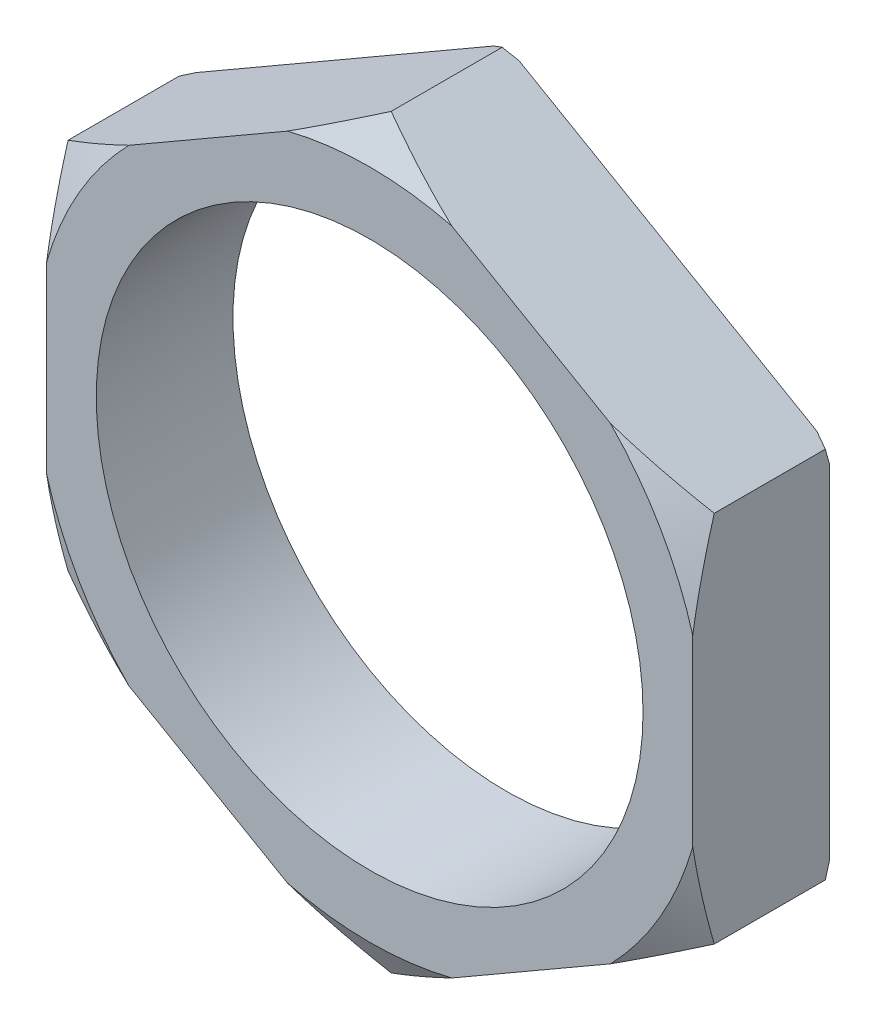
ISO-10303-21;
HEADER;
FILE_DESCRIPTION(('STEP AP214'),'2;1');
FILE_NAME('part.step','',(''),(''),'','','');
FILE_SCHEMA(('AUTOMOTIVE_DESIGN { 1 0 10303 214 1 1 1 1 }'));
ENDSEC;
DATA;
#1=APPLICATION_CONTEXT('core data for automotive mechanical design processes');
#2=APPLICATION_PROTOCOL_DEFINITION('international standard','automotive_design',2000,#1);
#3=PRODUCT_CONTEXT('',#1,'mechanical');
#4=PRODUCT('Part','Part','',(#3));
#5=PRODUCT_RELATED_PRODUCT_CATEGORY('part','',(#4));
#6=PRODUCT_DEFINITION_FORMATION('','',#4);
#7=PRODUCT_DEFINITION_CONTEXT('part definition',#1,'design');
#8=PRODUCT_DEFINITION('design','',#6,#7);
#9=PRODUCT_DEFINITION_SHAPE('','',#8);
#10=(LENGTH_UNIT() NAMED_UNIT(*) SI_UNIT(.MILLI.,.METRE.));
#11=(NAMED_UNIT(*) PLANE_ANGLE_UNIT() SI_UNIT($,.RADIAN.));
#12=(NAMED_UNIT(*) SI_UNIT($,.STERADIAN.) SOLID_ANGLE_UNIT());
#13=UNCERTAINTY_MEASURE_WITH_UNIT(LENGTH_MEASURE(1.E-05),#10,'distance_accuracy_value','');
#14=(GEOMETRIC_REPRESENTATION_CONTEXT(3) GLOBAL_UNCERTAINTY_ASSIGNED_CONTEXT((#13)) GLOBAL_UNIT_ASSIGNED_CONTEXT((#10,
#11,#12)) REPRESENTATION_CONTEXT('',''));
#15=CARTESIAN_POINT('',(0.,0.,0.));
#16=DIRECTION('',(0.,0.,1.));
#17=DIRECTION('',(1.,0.,0.));
#18=AXIS2_PLACEMENT_3D('',#15,#16,#17);
#19=CARTESIAN_POINT('',(0.,0.,4.62902937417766));
#20=DIRECTION('',(0.,0.,-1.));
#21=DIRECTION('',(-1.,0.,0.));
#22=AXIS2_PLACEMENT_3D('',#19,#20,#21);
#23=CONICAL_SURFACE('',#22,15.0201044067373,1.0471975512);
#24=CARTESIAN_POINT('',(12.9999999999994,7.50555349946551,4.63422402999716));
#25=CARTESIAN_POINT('',(12.7279391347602,7.66262791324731,4.72490285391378));
#26=CARTESIAN_POINT('',(12.4548725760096,7.82028296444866,4.81166288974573));
#27=CARTESIAN_POINT('',(11.9070071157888,8.13659323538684,4.97620481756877));
#28=CARTESIAN_POINT('',(11.6322101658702,8.29524732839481,5.053995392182));
#29=CARTESIAN_POINT('',(11.0805896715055,8.61372556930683,5.19965011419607));
#30=CARTESIAN_POINT('',(10.8037658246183,8.77354989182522,5.26751274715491));
#31=CARTESIAN_POINT('',(10.2479963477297,9.09442354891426,5.39227833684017));
#32=CARTESIAN_POINT('',(9.96904890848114,9.25547392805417,5.44917051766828));
#33=CARTESIAN_POINT('',(9.68924211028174,9.41702045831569,5.49999999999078));
#34=B_SPLINE_CURVE_WITH_KNOTS('',3,(#24,#25,#26,#27,#28,#29,#30,#31,#32,#33),.UNSPECIFIED.,.F.,
.F.,(4,2,2,2,4),(0.,0.980939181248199,1.96092067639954,2.94105150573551,3.92214023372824),.UNSPECIFIED.);
#35=CARTESIAN_POINT('',(12.9999999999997,7.50555349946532,4.63422402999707));
#36=VERTEX_POINT('',#35);
#37=CARTESIAN_POINT('',(9.68924211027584,9.41702045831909,5.49999999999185));
#38=VERTEX_POINT('',#37);
#39=EDGE_CURVE('E168',#36,#38,#34,.T.);
#40=ORIENTED_EDGE('',*,*,#39,.T.);
#41=CARTESIAN_POINT('',(0.,0.,5.49999999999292));
#42=DIRECTION('',(0.,0.,-1.));
#43=DIRECTION('',(-1.,0.,0.));
#44=AXIS2_PLACEMENT_3D('',#41,#42,#43);
#45=CIRCLE('',#44,13.5115390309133);
#46=CARTESIAN_POINT('',(13.,3.68261958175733,5.49999999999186));
#47=VERTEX_POINT('',#46);
#48=EDGE_CURVE('E366',#47,#38,#45,.F.);
#49=ORIENTED_EDGE('',*,*,#48,.F.);
#50=CARTESIAN_POINT('',(13.,3.68261958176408,5.4999999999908));
#51=CARTESIAN_POINT('',(13.,4.00571264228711,5.44917051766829));
#52=CARTESIAN_POINT('',(13.,4.32781340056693,5.39227833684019));
#53=CARTESIAN_POINT('',(13.,4.96956071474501,5.26751274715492));
#54=CARTESIAN_POINT('',(13.,5.28920935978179,5.19965011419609));
#55=CARTESIAN_POINT('',(13.,5.92616584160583,5.05399539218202));
#56=CARTESIAN_POINT('',(13.,6.24347402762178,4.97620481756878));
#57=CARTESIAN_POINT('',(13.,6.87609456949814,4.81166288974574));
#58=CARTESIAN_POINT('',(13.,7.19140467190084,4.72490285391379));
#59=CARTESIAN_POINT('',(13.,7.50555349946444,4.63422402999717));
#60=B_SPLINE_CURVE_WITH_KNOTS('',3,(#50,#51,#52,#53,#54,#55,#56,#57,#58,#59),.UNSPECIFIED.,.F.,
.F.,(4,2,2,2,4),(0.,0.981088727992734,1.9612195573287,2.94120105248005,3.92214023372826),.UNSPECIFIED.);
#61=EDGE_CURVE('E459',#47,#36,#60,.T.);
#62=ORIENTED_EDGE('',*,*,#61,.T.);
#63=EDGE_LOOP('',(#40,#49,#62));
#64=FACE_BOUND('',#63,.T.);
#65=ADVANCED_FACE('F14',(#64),#23,.T.);
#66=CARTESIAN_POINT('',(0.,0.,4.62902937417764));
#67=DIRECTION('',(0.,0.,-1.));
#68=DIRECTION('',(0.,1.,0.));
#69=AXIS2_PLACEMENT_3D('',#66,#67,#68);
#70=CONICAL_SURFACE('',#69,15.0201044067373,1.0471975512);
#71=CARTESIAN_POINT('',(0.,0.,5.49999999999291));
#72=DIRECTION('',(0.,0.,-1.));
#73=DIRECTION('',(0.,1.,0.));
#74=AXIS2_PLACEMENT_3D('',#71,#72,#73);
#75=CIRCLE('',#74,13.5115390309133);
#76=CARTESIAN_POINT('',(3.31075788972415,13.0996400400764,5.49999999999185));
#77=VERTEX_POINT('',#76);
#78=CARTESIAN_POINT('',(-3.31075788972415,13.0996400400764,5.49999999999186));
#79=VERTEX_POINT('',#78);
#80=EDGE_CURVE('E166',#77,#79,#75,.F.);
#81=ORIENTED_EDGE('',*,*,#80,.F.);
#82=CARTESIAN_POINT('',(3.31075788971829,13.0996400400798,5.49999999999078));
#83=CARTESIAN_POINT('',(3.03095109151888,13.2611865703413,5.44917051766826));
#84=CARTESIAN_POINT('',(2.75200365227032,13.4222369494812,5.39227833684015));
#85=CARTESIAN_POINT('',(2.19623417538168,13.7431106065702,5.26751274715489));
#86=CARTESIAN_POINT('',(1.91941032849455,13.9029349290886,5.19965011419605));
#87=CARTESIAN_POINT('',(1.36778983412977,14.2214131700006,5.05399539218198));
#88=CARTESIAN_POINT('',(1.09299288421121,14.3800672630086,4.97620481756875));
#89=CARTESIAN_POINT('',(0.545127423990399,14.6963775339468,4.81166288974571));
#90=CARTESIAN_POINT('',(0.272060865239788,14.8540325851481,4.72490285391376));
#91=CARTESIAN_POINT('',(6.18709074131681E-13,15.01110699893,4.63422402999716));
#92=B_SPLINE_CURVE_WITH_KNOTS('',3,(#82,#83,#84,#85,#86,#87,#88,#89,#90,#91),.UNSPECIFIED.,.F.,
.F.,(4,2,2,2,4),(0.,0.981088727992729,1.96121955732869,2.94120105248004,3.92214023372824),.UNSPECIFIED.);
#93=CARTESIAN_POINT('',(-2.96555850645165E-13,15.0111069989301,4.63422402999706));
#94=VERTEX_POINT('',#93);
#95=EDGE_CURVE('E157',#77,#94,#92,.T.);
#96=ORIENTED_EDGE('',*,*,#95,.T.);
#97=CARTESIAN_POINT('',(-5.93037075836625E-13,15.0111069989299,4.63422402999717));
#98=CARTESIAN_POINT('',(-0.272060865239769,14.8540325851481,4.72490285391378));
#99=CARTESIAN_POINT('',(-0.545127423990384,14.6963775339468,4.81166288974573));
#100=CARTESIAN_POINT('',(-1.0929928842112,14.3800672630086,4.97620481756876));
#101=CARTESIAN_POINT('',(-1.36778983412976,14.2214131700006,5.053995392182));
#102=CARTESIAN_POINT('',(-1.91941032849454,13.9029349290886,5.19965011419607));
#103=CARTESIAN_POINT('',(-2.19623417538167,13.7431106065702,5.26751274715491));
#104=CARTESIAN_POINT('',(-2.75200365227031,13.4222369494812,5.39227833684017));
#105=CARTESIAN_POINT('',(-3.03095109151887,13.2611865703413,5.44917051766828));
#106=CARTESIAN_POINT('',(-3.31075788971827,13.0996400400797,5.4999999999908));
#107=B_SPLINE_CURVE_WITH_KNOTS('',3,(#97,#98,#99,#100,#101,#102,#103,#104,#105,#106),
.UNSPECIFIED.,.F.,.F.,(4,2,2,2,4),(0.,0.9809391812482,1.96092067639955,2.94105150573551,
3.92214023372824),.UNSPECIFIED.);
#108=EDGE_CURVE('E18',#94,#79,#107,.T.);
#109=ORIENTED_EDGE('',*,*,#108,.T.);
#110=EDGE_LOOP('',(#81,#96,#109));
#111=FACE_BOUND('',#110,.T.);
#112=ADVANCED_FACE('F164',(#111),#70,.T.);
#113=CARTESIAN_POINT('',(0.,0.,4.62902937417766));
#114=DIRECTION('',(0.,0.,-1.));
#115=DIRECTION('',(-1.,0.,0.));
#116=AXIS2_PLACEMENT_3D('',#113,#114,#115);
#117=CONICAL_SURFACE('',#116,15.0201044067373,1.0471975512);
#118=CARTESIAN_POINT('',(-13.,7.50555349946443,4.63422402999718));
#119=CARTESIAN_POINT('',(-13.,7.19140467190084,4.72490285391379));
#120=CARTESIAN_POINT('',(-13.,6.87609456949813,4.81166288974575));
#121=CARTESIAN_POINT('',(-13.,6.24347402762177,4.97620481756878));
#122=CARTESIAN_POINT('',(-13.,5.92616584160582,5.05399539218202));
#123=CARTESIAN_POINT('',(-13.,5.28920935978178,5.19965011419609));
#124=CARTESIAN_POINT('',(-13.,4.969560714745,5.26751274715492));
#125=CARTESIAN_POINT('',(-13.,4.32781340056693,5.39227833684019));
#126=CARTESIAN_POINT('',(-13.,4.00571264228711,5.44917051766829));
#127=CARTESIAN_POINT('',(-13.,3.68261958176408,5.4999999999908));
#128=B_SPLINE_CURVE_WITH_KNOTS('',3,(#118,#119,#120,#121,#122,#123,#124,#125,#126,#127),
.UNSPECIFIED.,.F.,.F.,(4,2,2,2,4),(0.,0.980939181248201,1.96092067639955,2.94105150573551,
3.92214023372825),.UNSPECIFIED.);
#129=CARTESIAN_POINT('',(-12.9999999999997,7.50555349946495,4.63422402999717));
#130=VERTEX_POINT('',#129);
#131=CARTESIAN_POINT('',(-13.,3.68261958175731,5.49999999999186));
#132=VERTEX_POINT('',#131);
#133=EDGE_CURVE('E209',#130,#132,#128,.T.);
#134=ORIENTED_EDGE('',*,*,#133,.T.);
#135=CARTESIAN_POINT('',(0.,0.,5.49999999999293));
#136=DIRECTION('',(0.,0.,-1.));
#137=DIRECTION('',(-1.,0.,0.));
#138=AXIS2_PLACEMENT_3D('',#135,#136,#137);
#139=CIRCLE('',#138,13.5115390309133);
#140=CARTESIAN_POINT('',(-9.68924211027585,9.41702045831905,5.49999999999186));
#141=VERTEX_POINT('',#140);
#142=EDGE_CURVE('E362',#141,#132,#139,.F.);
#143=ORIENTED_EDGE('',*,*,#142,.F.);
#144=CARTESIAN_POINT('',(-9.68924211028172,9.41702045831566,5.4999999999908));
#145=CARTESIAN_POINT('',(-9.96904890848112,9.25547392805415,5.4491705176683));
#146=CARTESIAN_POINT('',(-10.2479963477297,9.09442354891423,5.39227833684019));
#147=CARTESIAN_POINT('',(-10.8037658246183,8.77354989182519,5.26751274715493));
#148=CARTESIAN_POINT('',(-11.0805896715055,8.6137255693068,5.19965011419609));
#149=CARTESIAN_POINT('',(-11.6322101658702,8.29524732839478,5.05399539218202));
#150=CARTESIAN_POINT('',(-11.9070071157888,8.13659323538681,4.97620481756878));
#151=CARTESIAN_POINT('',(-12.4548725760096,7.82028296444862,4.81166288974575));
#152=CARTESIAN_POINT('',(-12.7279391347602,7.66262791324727,4.72490285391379));
#153=CARTESIAN_POINT('',(-12.9999999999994,7.50555349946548,4.63422402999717));
#154=B_SPLINE_CURVE_WITH_KNOTS('',3,(#144,#145,#146,#147,#148,#149,#150,#151,#152,#153),
.UNSPECIFIED.,.F.,.F.,(4,2,2,2,4),(0.,0.981088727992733,1.96121955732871,2.94120105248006,
3.92214023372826),.UNSPECIFIED.);
#155=EDGE_CURVE('E152',#141,#130,#154,.T.);
#156=ORIENTED_EDGE('',*,*,#155,.T.);
#157=EDGE_LOOP('',(#134,#143,#156));
#158=FACE_BOUND('',#157,.T.);
#159=ADVANCED_FACE('F198',(#158),#117,.T.);
#160=CARTESIAN_POINT('',(0.,0.,4.62902937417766));
#161=DIRECTION('',(0.,0.,-1.));
#162=DIRECTION('',(-1.,0.,0.));
#163=AXIS2_PLACEMENT_3D('',#160,#161,#162);
#164=CONICAL_SURFACE('',#163,15.0201044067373,1.0471975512);
#165=CARTESIAN_POINT('',(-12.9999999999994,-7.50555349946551,4.63422402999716));
#166=CARTESIAN_POINT('',(-12.7279391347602,-7.66262791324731,4.72490285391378));
#167=CARTESIAN_POINT('',(-12.4548725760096,-7.82028296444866,4.81166288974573));
#168=CARTESIAN_POINT('',(-11.9070071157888,-8.13659323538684,4.97620481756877));
#169=CARTESIAN_POINT('',(-11.6322101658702,-8.29524732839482,5.053995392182));
#170=CARTESIAN_POINT('',(-11.0805896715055,-8.61372556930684,5.19965011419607));
#171=CARTESIAN_POINT('',(-10.8037658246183,-8.77354989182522,5.26751274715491));
#172=CARTESIAN_POINT('',(-10.2479963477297,-9.09442354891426,5.39227833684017));
#173=CARTESIAN_POINT('',(-9.96904890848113,-9.25547392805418,5.44917051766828));
#174=CARTESIAN_POINT('',(-9.68924211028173,-9.41702045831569,5.49999999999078));
#175=B_SPLINE_CURVE_WITH_KNOTS('',3,(#165,#166,#167,#168,#169,#170,#171,#172,#173,#174),
.UNSPECIFIED.,.F.,.F.,(4,2,2,2,4),(0.,0.980939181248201,1.96092067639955,2.94105150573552,
3.92214023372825),.UNSPECIFIED.);
#176=CARTESIAN_POINT('',(-12.9999999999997,-7.50555349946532,4.63422402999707));
#177=VERTEX_POINT('',#176);
#178=CARTESIAN_POINT('',(-9.68924211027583,-9.41702045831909,5.49999999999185));
#179=VERTEX_POINT('',#178);
#180=EDGE_CURVE('E245',#177,#179,#175,.T.);
#181=ORIENTED_EDGE('',*,*,#180,.T.);
#182=CARTESIAN_POINT('',(0.,0.,5.49999999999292));
#183=DIRECTION('',(0.,0.,-1.));
#184=DIRECTION('',(-1.,0.,0.));
#185=AXIS2_PLACEMENT_3D('',#182,#183,#184);
#186=CIRCLE('',#185,13.5115390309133);
#187=CARTESIAN_POINT('',(-13.,-3.68261958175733,5.49999999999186));
#188=VERTEX_POINT('',#187);
#189=EDGE_CURVE('E343',#188,#179,#186,.F.);
#190=ORIENTED_EDGE('',*,*,#189,.F.);
#191=CARTESIAN_POINT('',(-13.,-3.68261958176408,5.4999999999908));
#192=CARTESIAN_POINT('',(-13.,-4.00571264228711,5.44917051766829));
#193=CARTESIAN_POINT('',(-13.,-4.32781340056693,5.39227833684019));
#194=CARTESIAN_POINT('',(-13.,-4.96956071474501,5.26751274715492));
#195=CARTESIAN_POINT('',(-13.,-5.28920935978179,5.19965011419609));
#196=CARTESIAN_POINT('',(-13.,-5.92616584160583,5.05399539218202));
#197=CARTESIAN_POINT('',(-13.,-6.24347402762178,4.97620481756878));
#198=CARTESIAN_POINT('',(-13.,-6.87609456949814,4.81166288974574));
#199=CARTESIAN_POINT('',(-13.,-7.19140467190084,4.72490285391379));
#200=CARTESIAN_POINT('',(-13.,-7.50555349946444,4.63422402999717));
#201=B_SPLINE_CURVE_WITH_KNOTS('',3,(#191,#192,#193,#194,#195,#196,#197,#198,#199,#200),
.UNSPECIFIED.,.F.,.F.,(4,2,2,2,4),(0.,0.981088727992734,1.9612195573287,2.94120105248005,
3.92214023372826),.UNSPECIFIED.);
#202=EDGE_CURVE('E344',#188,#177,#201,.T.);
#203=ORIENTED_EDGE('',*,*,#202,.T.);
#204=EDGE_LOOP('',(#181,#190,#203));
#205=FACE_BOUND('',#204,.T.);
#206=ADVANCED_FACE('F203',(#205),#164,.T.);
#207=CARTESIAN_POINT('',(0.,0.,4.62902937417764));
#208=DIRECTION('',(0.,0.,-1.));
#209=DIRECTION('',(0.,1.,0.));
#210=AXIS2_PLACEMENT_3D('',#207,#208,#209);
#211=CONICAL_SURFACE('',#210,15.0201044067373,1.0471975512);
#212=CARTESIAN_POINT('',(5.90305715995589E-13,-15.0111069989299,4.63422402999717));
#213=CARTESIAN_POINT('',(0.272060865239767,-14.8540325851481,4.72490285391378));
#214=CARTESIAN_POINT('',(0.545127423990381,-14.6963775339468,4.81166288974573));
#215=CARTESIAN_POINT('',(1.09299288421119,-14.3800672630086,4.97620481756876));
#216=CARTESIAN_POINT('',(1.36778983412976,-14.2214131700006,5.053995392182));
#217=CARTESIAN_POINT('',(1.91941032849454,-13.9029349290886,5.19965011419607));
#218=CARTESIAN_POINT('',(2.19623417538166,-13.7431106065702,5.2675127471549));
#219=CARTESIAN_POINT('',(2.75200365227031,-13.4222369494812,5.39227833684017));
#220=CARTESIAN_POINT('',(3.03095109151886,-13.2611865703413,5.44917051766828));
#221=CARTESIAN_POINT('',(3.31075788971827,-13.0996400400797,5.4999999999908));
#222=B_SPLINE_CURVE_WITH_KNOTS('',3,(#212,#213,#214,#215,#216,#217,#218,#219,#220,#221),
.UNSPECIFIED.,.F.,.F.,(4,2,2,2,4),(0.,0.980939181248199,1.96092067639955,2.94105150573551,
3.92214023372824),.UNSPECIFIED.);
#223=CARTESIAN_POINT('',(2.95297956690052E-13,-15.0111069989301,4.63422402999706));
#224=VERTEX_POINT('',#223);
#225=CARTESIAN_POINT('',(3.31075788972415,-13.0996400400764,5.49999999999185));
#226=VERTEX_POINT('',#225);
#227=EDGE_CURVE('E244',#224,#226,#222,.T.);
#228=ORIENTED_EDGE('',*,*,#227,.T.);
#229=CARTESIAN_POINT('',(0.,0.,5.49999999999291));
#230=DIRECTION('',(0.,0.,-1.));
#231=DIRECTION('',(0.,1.,0.));
#232=AXIS2_PLACEMENT_3D('',#229,#230,#231);
#233=CIRCLE('',#232,13.5115390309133);
#234=CARTESIAN_POINT('',(-3.31075788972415,-13.0996400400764,5.49999999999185));
#235=VERTEX_POINT('',#234);
#236=EDGE_CURVE('E351',#235,#226,#233,.F.);
#237=ORIENTED_EDGE('',*,*,#236,.F.);
#238=CARTESIAN_POINT('',(-3.31075788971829,-13.0996400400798,5.49999999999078));
#239=CARTESIAN_POINT('',(-3.03095109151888,-13.2611865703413,5.44917051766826));
#240=CARTESIAN_POINT('',(-2.75200365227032,-13.4222369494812,5.39227833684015));
#241=CARTESIAN_POINT('',(-2.19623417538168,-13.7431106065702,5.26751274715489));
#242=CARTESIAN_POINT('',(-1.91941032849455,-13.9029349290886,5.19965011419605));
#243=CARTESIAN_POINT('',(-1.36778983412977,-14.2214131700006,5.05399539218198));
#244=CARTESIAN_POINT('',(-1.09299288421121,-14.3800672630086,4.97620481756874));
#245=CARTESIAN_POINT('',(-0.545127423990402,-14.6963775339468,4.81166288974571));
#246=CARTESIAN_POINT('',(-0.27206086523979,-14.8540325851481,4.72490285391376));
#247=CARTESIAN_POINT('',(-6.21417800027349E-13,-15.01110699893,4.63422402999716));
#248=B_SPLINE_CURVE_WITH_KNOTS('',3,(#238,#239,#240,#241,#242,#243,#244,#245,#246,#247),
.UNSPECIFIED.,.F.,.F.,(4,2,2,2,4),(0.,0.981088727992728,1.96121955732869,2.94120105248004,
3.92214023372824),.UNSPECIFIED.);
#249=EDGE_CURVE('E308',#235,#224,#248,.T.);
#250=ORIENTED_EDGE('',*,*,#249,.T.);
#251=EDGE_LOOP('',(#228,#237,#250));
#252=FACE_BOUND('',#251,.T.);
#253=ADVANCED_FACE('F229',(#252),#211,.T.);
#254=CARTESIAN_POINT('',(0.,0.,4.62902937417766));
#255=DIRECTION('',(0.,0.,-1.));
#256=DIRECTION('',(-1.,0.,0.));
#257=AXIS2_PLACEMENT_3D('',#254,#255,#256);
#258=CONICAL_SURFACE('',#257,15.0201044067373,1.0471975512);
#259=CARTESIAN_POINT('',(0.,0.,5.49999999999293));
#260=DIRECTION('',(0.,0.,-1.));
#261=DIRECTION('',(-1.,0.,0.));
#262=AXIS2_PLACEMENT_3D('',#259,#260,#261);
#263=CIRCLE('',#262,13.5115390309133);
#264=CARTESIAN_POINT('',(9.68924211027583,-9.41702045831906,5.49999999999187));
#265=VERTEX_POINT('',#264);
#266=CARTESIAN_POINT('',(13.,-3.6826195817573,5.49999999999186));
#267=VERTEX_POINT('',#266);
#268=EDGE_CURVE('E436',#265,#267,#263,.F.);
#269=ORIENTED_EDGE('',*,*,#268,.F.);
#270=CARTESIAN_POINT('',(9.68924211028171,-9.41702045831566,5.4999999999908));
#271=CARTESIAN_POINT('',(9.96904890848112,-9.25547392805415,5.4491705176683));
#272=CARTESIAN_POINT('',(10.2479963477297,-9.09442354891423,5.39227833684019));
#273=CARTESIAN_POINT('',(10.8037658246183,-8.7735498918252,5.26751274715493));
#274=CARTESIAN_POINT('',(11.0805896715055,-8.6137255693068,5.19965011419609));
#275=CARTESIAN_POINT('',(11.6322101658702,-8.29524732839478,5.05399539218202));
#276=CARTESIAN_POINT('',(11.9070071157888,-8.13659323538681,4.97620481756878));
#277=CARTESIAN_POINT('',(12.4548725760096,-7.82028296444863,4.81166288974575));
#278=CARTESIAN_POINT('',(12.7279391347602,-7.66262791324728,4.72490285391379));
#279=CARTESIAN_POINT('',(12.9999999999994,-7.50555349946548,4.63422402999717));
#280=B_SPLINE_CURVE_WITH_KNOTS('',3,(#270,#271,#272,#273,#274,#275,#276,#277,#278,#279),
.UNSPECIFIED.,.F.,.F.,(4,2,2,2,4),(0.,0.981088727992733,1.96121955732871,2.94120105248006,
3.92214023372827),.UNSPECIFIED.);
#281=CARTESIAN_POINT('',(13.,-7.50555349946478,4.63422402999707));
#282=VERTEX_POINT('',#281);
#283=EDGE_CURVE('E234',#265,#282,#280,.T.);
#284=ORIENTED_EDGE('',*,*,#283,.T.);
#285=CARTESIAN_POINT('',(13.,-7.50555349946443,4.63422402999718));
#286=CARTESIAN_POINT('',(13.,-7.19140467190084,4.72490285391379));
#287=CARTESIAN_POINT('',(13.,-6.87609456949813,4.81166288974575));
#288=CARTESIAN_POINT('',(13.,-6.24347402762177,4.97620481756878));
#289=CARTESIAN_POINT('',(13.,-5.92616584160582,5.05399539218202));
#290=CARTESIAN_POINT('',(13.,-5.28920935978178,5.19965011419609));
#291=CARTESIAN_POINT('',(13.,-4.969560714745,5.26751274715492));
#292=CARTESIAN_POINT('',(13.,-4.32781340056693,5.39227833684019));
#293=CARTESIAN_POINT('',(13.,-4.00571264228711,5.44917051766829));
#294=CARTESIAN_POINT('',(13.,-3.68261958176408,5.4999999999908));
#295=B_SPLINE_CURVE_WITH_KNOTS('',3,(#285,#286,#287,#288,#289,#290,#291,#292,#293,#294),
.UNSPECIFIED.,.F.,.F.,(4,2,2,2,4),(0.,0.980939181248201,1.96092067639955,2.94105150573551,
3.92214023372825),.UNSPECIFIED.);
#296=EDGE_CURVE('E180',#282,#267,#295,.T.);
#297=ORIENTED_EDGE('',*,*,#296,.T.);
#298=EDGE_LOOP('',(#269,#284,#297));
#299=FACE_BOUND('',#298,.T.);
#300=ADVANCED_FACE('F224',(#299),#258,.T.);
#301=CARTESIAN_POINT('',(-13.,7.50555349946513,-7.65));
#302=DIRECTION('',(0.5,-0.866025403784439,0.));
#303=DIRECTION('',(-0.866025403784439,-0.5,0.));
#304=AXIS2_PLACEMENT_3D('',#301,#302,#303);
#305=PLANE('',#304);
#306=DIRECTION('',(-0.866025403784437,-0.5,0.));
#307=VECTOR('',#306,1.);
#308=CARTESIAN_POINT('',(-3.31075788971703,13.0996400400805,5.5));
#309=LINE('',#308,#307);
#310=EDGE_CURVE('E148',#79,#141,#309,.T.);
#311=ORIENTED_EDGE('',*,*,#310,.F.);
#312=ORIENTED_EDGE('',*,*,#108,.F.);
#313=DIRECTION('',(0.,0.,-1.));
#314=VECTOR('',#313,1.);
#315=CARTESIAN_POINT('',(0.,15.0111069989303,-7.65));
#316=LINE('',#315,#314);
#317=CARTESIAN_POINT('',(-5.62514159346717E-07,15.0111066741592,0.165775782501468));
#318=VERTEX_POINT('',#317);
#319=EDGE_CURVE('E146',#94,#318,#316,.T.);
#320=ORIENTED_EDGE('',*,*,#319,.T.);
#321=CARTESIAN_POINT('',(-3.75018778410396E-07,15.0111067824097,0.165775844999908));
#322=CARTESIAN_POINT('',(-0.0214686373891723,14.9987120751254,0.158619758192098));
#323=CARTESIAN_POINT('',(-0.0429430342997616,14.9863138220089,0.15148821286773));
#324=CARTESIAN_POINT('',(-0.0858600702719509,14.9615356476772,0.137289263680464));
#325=CARTESIAN_POINT('',(-0.107302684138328,14.9491557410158,0.130221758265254));
#326=CARTESIAN_POINT('',(-0.150156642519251,14.9244139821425,0.116150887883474));
#327=CARTESIAN_POINT('',(-0.171567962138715,14.9120521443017,0.10914742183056));
#328=CARTESIAN_POINT('',(-0.214359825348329,14.8873462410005,0.0952046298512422));
#329=CARTESIAN_POINT('',(-0.235740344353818,14.8750021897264,0.0882652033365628));
#330=CARTESIAN_POINT('',(-0.27847110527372,14.8503315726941,0.0744504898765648));
#331=CARTESIAN_POINT('',(-0.29982132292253,14.8380050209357,0.0675751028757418));
#332=CARTESIAN_POINT('',(-0.342491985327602,14.8133691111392,0.05388846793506));
#333=CARTESIAN_POINT('',(-0.363812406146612,14.8010597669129,0.0470771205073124));
#334=CARTESIAN_POINT('',(-0.406423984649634,14.7764579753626,0.033518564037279));
#335=CARTESIAN_POINT('',(-0.427715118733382,14.7641655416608,0.0267712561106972));
#336=CARTESIAN_POINT('',(-0.470268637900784,14.7395972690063,0.0133407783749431));
#337=CARTESIAN_POINT('',(-0.491530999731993,14.7273214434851,0.0066575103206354));
#338=CARTESIAN_POINT('',(-0.512799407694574,14.7150421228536,6.7595126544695E-12));
#339=B_SPLINE_CURVE_WITH_KNOTS('',3,(#321,#322,#323,#324,#325,#326,#327,#328,#329,#330,#331,
#332,#333,#334,#335,#336,#337,#338),.UNSPECIFIED.,.F.,.F.,(4,2,2,2,2,2,2,2,4),(0.,
0.0774049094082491,0.15465106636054,0.231740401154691,0.308674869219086,0.385456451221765,
0.462087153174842,0.53856900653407,0.614904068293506),.UNSPECIFIED.);
#340=CARTESIAN_POINT('',(-0.512799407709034,14.7150421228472,3.37924133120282E-12));
#341=VERTEX_POINT('',#340);
#342=EDGE_CURVE('E162',#341,#318,#339,.F.);
#343=ORIENTED_EDGE('',*,*,#342,.F.);
#344=DIRECTION('',(0.866025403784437,0.5,0.));
#345=VECTOR('',#344,1.);
#346=CARTESIAN_POINT('',(-12.4872005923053,7.80161837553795,0.));
#347=LINE('',#346,#345);
#348=CARTESIAN_POINT('',(-12.4872005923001,7.80161837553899,6.73766598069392E-12));
#349=VERTEX_POINT('',#348);
#350=EDGE_CURVE('E435',#349,#341,#347,.T.);
#351=ORIENTED_EDGE('',*,*,#350,.F.);
#352=CARTESIAN_POINT('',(-12.487200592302,7.80161837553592,6.73847913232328E-12));
#353=CARTESIAN_POINT('',(-12.5084689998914,7.78933905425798,0.00665751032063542));
#354=CARTESIAN_POINT('',(-12.5297313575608,7.77706322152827,0.0133407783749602));
#355=CARTESIAN_POINT('',(-12.5722848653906,7.75249492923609,0.0267712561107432));
#356=CARTESIAN_POINT('',(-12.5935759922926,7.74020248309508,0.033518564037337));
#357=CARTESIAN_POINT('',(-12.6361875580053,7.71560066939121,0.0470771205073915));
#358=CARTESIAN_POINT('',(-12.6575079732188,7.70329131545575,0.0538884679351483));
#359=CARTESIAN_POINT('',(-12.7001786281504,7.67865539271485,0.0675751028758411));
#360=CARTESIAN_POINT('',(-12.7215288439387,7.66632883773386,0.0744504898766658));
#361=CARTESIAN_POINT('',(-12.7642596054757,7.64165822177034,0.0882652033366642));
#362=CARTESIAN_POINT('',(-12.7856401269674,7.62931417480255,0.0952046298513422));
#363=CARTESIAN_POINT('',(-12.8284319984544,7.60460828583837,0.109147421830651));
#364=CARTESIAN_POINT('',(-12.8498433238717,7.59224645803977,0.116150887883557));
#365=CARTESIAN_POINT('',(-12.8926972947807,7.56750472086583,0.130221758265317));
#366=CARTESIAN_POINT('',(-12.9141399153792,7.55512482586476,0.137289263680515));
#367=CARTESIAN_POINT('',(-12.9570569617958,7.53034666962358,0.151488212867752));
#368=CARTESIAN_POINT('',(-12.9785313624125,7.51794842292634,0.158619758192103));
#369=CARTESIAN_POINT('',(-12.9999996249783,7.50555371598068,0.165775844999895));
#370=B_SPLINE_CURVE_WITH_KNOTS('',3,(#352,#353,#354,#355,#356,#357,#358,#359,#360,#361,#362,
#363,#364,#365,#366,#367,#368,#369),.UNSPECIFIED.,.F.,.F.,(4,2,2,2,2,2,2,2,4),(0.,
0.0763350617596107,0.15281691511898,0.229447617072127,0.30622919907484,0.383163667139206,
0.460253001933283,0.537499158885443,0.614904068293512),.UNSPECIFIED.);
#371=CARTESIAN_POINT('',(-12.9999999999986,7.50555306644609,0.165775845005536));
#372=VERTEX_POINT('',#371);
#373=EDGE_CURVE('E384',#372,#349,#370,.F.);
#374=ORIENTED_EDGE('',*,*,#373,.F.);
#375=DIRECTION('',(0.,0.,-1.));
#376=VECTOR('',#375,1.);
#377=CARTESIAN_POINT('',(-13.,7.50555349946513,-7.65));
#378=LINE('',#377,#376);
#379=EDGE_CURVE('E371',#372,#130,#378,.F.);
#380=ORIENTED_EDGE('',*,*,#379,.T.);
#381=ORIENTED_EDGE('',*,*,#155,.F.);
#382=EDGE_LOOP('',(#311,#312,#320,#343,#351,#374,#380,#381));
#383=FACE_BOUND('',#382,.T.);
#384=ADVANCED_FACE('F144',(#383),#305,.F.);
#385=CARTESIAN_POINT('',(0.,0.,0.166770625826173));
#386=DIRECTION('',(0.,0.,1.));
#387=DIRECTION('',(1.,0.,0.));
#388=AXIS2_PLACEMENT_3D('',#385,#386,#387);
#389=CONICAL_SURFACE('',#388,15.0128297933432,1.0471975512);
#390=CARTESIAN_POINT('',(0.512799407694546,14.7150421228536,6.75449821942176E-12));
#391=CARTESIAN_POINT('',(0.491530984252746,14.727321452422,0.00665751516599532));
#392=CARTESIAN_POINT('',(0.470268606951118,14.739597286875,0.0133407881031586));
#393=CARTESIAN_POINT('',(0.427715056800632,14.7641655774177,0.0267712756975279));
#394=CARTESIAN_POINT('',(0.406423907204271,14.7764580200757,0.0335185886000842));
#395=CARTESIAN_POINT('',(0.36381229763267,14.8010598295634,0.0470771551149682));
#396=CARTESIAN_POINT('',(0.342491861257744,14.813369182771,0.0538885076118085));
#397=CARTESIAN_POINT('',(0.299821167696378,14.8380051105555,0.0675751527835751));
#398=CARTESIAN_POINT('',(0.278470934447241,14.8503316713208,0.0744505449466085));
#399=CARTESIAN_POINT('',(0.235740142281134,14.8750023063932,0.0882652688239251));
#400=CARTESIAN_POINT('',(0.214359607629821,14.8873463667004,0.0952047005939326));
#401=CARTESIAN_POINT('',(0.171567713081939,14.9120522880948,0.109147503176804));
#402=CARTESIAN_POINT('',(0.150156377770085,14.9244141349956,0.116150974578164));
#403=CARTESIAN_POINT('',(0.107302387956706,14.9491559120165,0.13022185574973));
#404=CARTESIAN_POINT('',(0.0858597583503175,14.9615358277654,0.137289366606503));
#405=CARTESIAN_POINT('',(0.0429426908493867,14.9863140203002,0.151488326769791));
#406=CARTESIAN_POINT('',(0.0214682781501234,14.9987122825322,0.158619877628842));
#407=CARTESIAN_POINT('',(0.,15.011106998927,0.165775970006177));
#408=B_SPLINE_CURVE_WITH_KNOTS('',3,(#390,#391,#392,#393,#394,#395,#396,#397,#398,#399,#400,
#401,#402,#403,#404,#405,#406,#407),.UNSPECIFIED.,.F.,.F.,(4,2,2,2,2,2,2,2,4),(0.,
0.0763351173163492,0.152817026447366,0.229447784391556,0.306229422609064,0.383163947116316,
0.460253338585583,0.537499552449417,0.61490451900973),.UNSPECIFIED.);
#409=CARTESIAN_POINT('',(0.51279940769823,14.7150421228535,6.75848266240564E-12));
#410=VERTEX_POINT('',#409);
#411=EDGE_CURVE('E161',#318,#410,#408,.F.);
#412=ORIENTED_EDGE('',*,*,#411,.T.);
#413=CARTESIAN_POINT('',(0.,0.,6.76021738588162E-12));
#414=DIRECTION('',(0.,0.,1.));
#415=DIRECTION('',(1.,0.,0.));
#416=AXIS2_PLACEMENT_3D('',#413,#414,#415);
#417=CIRCLE('',#416,14.7239745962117);
#418=EDGE_CURVE('E433',#341,#410,#417,.F.);
#419=ORIENTED_EDGE('',*,*,#418,.F.);
#420=ORIENTED_EDGE('',*,*,#342,.T.);
#421=EDGE_LOOP('',(#412,#419,#420));
#422=FACE_BOUND('',#421,.T.);
#423=ADVANCED_FACE('F223',(#422),#389,.T.);
#424=CARTESIAN_POINT('',(0.,15.0111069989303,-7.65));
#425=DIRECTION('',(-0.5,-0.866025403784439,0.));
#426=DIRECTION('',(-0.866025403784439,0.5,0.));
#427=AXIS2_PLACEMENT_3D('',#424,#425,#426);
#428=PLANE('',#427);
#429=DIRECTION('',(-0.866025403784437,0.5,0.));
#430=VECTOR('',#429,1.);
#431=CARTESIAN_POINT('',(9.68924211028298,9.41702045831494,5.5));
#432=LINE('',#431,#430);
#433=EDGE_CURVE('E364',#38,#77,#432,.T.);
#434=ORIENTED_EDGE('',*,*,#433,.F.);
#435=ORIENTED_EDGE('',*,*,#39,.F.);
#436=DIRECTION('',(0.,0.,1.));
#437=VECTOR('',#436,1.);
#438=CARTESIAN_POINT('',(13.,7.50555349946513,-7.65));
#439=LINE('',#438,#437);
#440=CARTESIAN_POINT('',(12.9999996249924,7.50555371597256,0.165775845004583));
#441=VERTEX_POINT('',#440);
#442=EDGE_CURVE('E170',#36,#441,#439,.F.);
#443=ORIENTED_EDGE('',*,*,#442,.T.);
#444=CARTESIAN_POINT('',(12.9999999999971,7.50555349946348,0.165775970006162));
#445=CARTESIAN_POINT('',(12.9785317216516,7.51794821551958,0.158619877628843));
#446=CARTESIAN_POINT('',(12.9570573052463,7.53034647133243,0.15148832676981));
#447=CARTESIAN_POINT('',(12.9141402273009,7.55512464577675,0.137289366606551));
#448=CARTESIAN_POINT('',(12.8926975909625,7.56750454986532,0.130221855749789));
#449=CARTESIAN_POINT('',(12.849843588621,7.59224630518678,0.116150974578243));
#450=CARTESIAN_POINT('',(12.8284322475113,7.60460814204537,0.10914750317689));
#451=CARTESIAN_POINT('',(12.785640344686,7.6293140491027,0.0952047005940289));
#452=CARTESIAN_POINT('',(12.7642598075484,7.6416581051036,0.0882652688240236));
#453=CARTESIAN_POINT('',(12.7215290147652,7.66632873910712,0.0744505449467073));
#454=CARTESIAN_POINT('',(12.7001787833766,7.67865530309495,0.0675751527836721));
#455=CARTESIAN_POINT('',(12.6575080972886,7.70329124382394,0.0538885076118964));
#456=CARTESIAN_POINT('',(12.6361876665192,7.71560060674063,0.0470771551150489));
#457=CARTESIAN_POINT('',(12.593576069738,7.74020243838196,0.033518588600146));
#458=CARTESIAN_POINT('',(12.5722849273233,7.75249489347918,0.0267712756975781));
#459=CARTESIAN_POINT('',(12.5297313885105,7.77706320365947,0.0133407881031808));
#460=CARTESIAN_POINT('',(12.5084690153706,7.78933904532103,0.00665751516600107));
#461=CARTESIAN_POINT('',(12.487200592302,7.80161837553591,6.74349356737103E-12));
#462=B_SPLINE_CURVE_WITH_KNOTS('',3,(#444,#445,#446,#447,#448,#449,#450,#451,#452,#453,#454,
#455,#456,#457,#458,#459,#460,#461),.UNSPECIFIED.,.F.,.F.,(4,2,2,2,2,2,2,2,4),(0.,
0.0774049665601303,0.154651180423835,0.231740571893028,0.308675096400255,0.385456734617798,
0.462087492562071,0.538569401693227,0.614904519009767),.UNSPECIFIED.);
#463=CARTESIAN_POINT('',(12.4872005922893,7.80161837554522,3.37230243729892E-12));
#464=VERTEX_POINT('',#463);
#465=EDGE_CURVE('E167',#464,#441,#462,.F.);
#466=ORIENTED_EDGE('',*,*,#465,.F.);
#467=DIRECTION('',(0.866025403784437,-0.5,0.));
#468=VECTOR('',#467,1.);
#469=CARTESIAN_POINT('',(0.512799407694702,14.7150421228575,0.));
#470=LINE('',#469,#468);
#471=EDGE_CURVE('E432',#410,#464,#470,.T.);
#472=ORIENTED_EDGE('',*,*,#471,.F.);
#473=ORIENTED_EDGE('',*,*,#411,.F.);
#474=ORIENTED_EDGE('',*,*,#319,.F.);
#475=ORIENTED_EDGE('',*,*,#95,.F.);
#476=EDGE_LOOP('',(#434,#435,#443,#466,#472,#473,#474,#475));
#477=FACE_BOUND('',#476,.T.);
#478=ADVANCED_FACE('F156',(#477),#428,.F.);
#479=CARTESIAN_POINT('',(0.,0.,0.166770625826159));
#480=DIRECTION('',(0.,0.,1.));
#481=DIRECTION('',(1.,0.,0.));
#482=AXIS2_PLACEMENT_3D('',#479,#480,#481);
#483=CONICAL_SURFACE('',#482,15.0128297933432,1.0471975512);
#484=CARTESIAN_POINT('',(0.,0.,6.7394007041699E-12));
#485=DIRECTION('',(0.,0.,1.));
#486=DIRECTION('',(1.,0.,0.));
#487=AXIS2_PLACEMENT_3D('',#484,#485,#486);
#488=CIRCLE('',#487,14.7239745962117);
#489=CARTESIAN_POINT('',(12.9999999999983,6.91342374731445,6.7394007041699E-12));
#490=VERTEX_POINT('',#489);
#491=EDGE_CURVE('E430',#464,#490,#488,.F.);
#492=ORIENTED_EDGE('',*,*,#491,.F.);
#493=ORIENTED_EDGE('',*,*,#465,.T.);
#494=CARTESIAN_POINT('',(12.9999999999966,6.91342374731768,6.73948201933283E-12));
#495=CARTESIAN_POINT('',(12.9999999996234,6.93798240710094,0.00665751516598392));
#496=CARTESIAN_POINT('',(12.9999999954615,6.96253408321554,0.0133407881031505));
#497=CARTESIAN_POINT('',(12.9999999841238,7.01167068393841,0.0267712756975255));
#498=CARTESIAN_POINT('',(12.999999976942,7.03625558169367,0.0335185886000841));
#499=CARTESIAN_POINT('',(12.9999999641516,7.08545922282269,0.0470771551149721));
#500=CARTESIAN_POINT('',(12.9999999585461,7.11007793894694,0.053888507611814));
#501=CARTESIAN_POINT('',(12.9999999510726,7.15934980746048,0.0675751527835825));
#502=CARTESIAN_POINT('',(12.9999999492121,7.1840029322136,0.074450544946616));
#503=CARTESIAN_POINT('',(12.9999999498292,7.23334420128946,0.0882652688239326));
#504=CARTESIAN_POINT('',(12.9999999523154,7.25803231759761,0.0952047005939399));
#505=CARTESIAN_POINT('',(12.9999999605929,7.30744414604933,0.109147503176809));
#506=CARTESIAN_POINT('',(12.9999999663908,7.33216782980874,0.116150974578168));
#507=CARTESIAN_POINT('',(12.9999999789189,7.38165136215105,0.13022185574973));
#508=CARTESIAN_POINT('',(12.999999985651,7.4064111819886,0.137289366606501));
#509=CARTESIAN_POINT('',(12.9999999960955,7.45596754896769,0.151488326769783));
#510=CARTESIAN_POINT('',(12.9999999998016,7.48076406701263,0.15861987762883));
#511=CARTESIAN_POINT('',(12.9999999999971,7.50555349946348,0.165775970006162));
#512=B_SPLINE_CURVE_WITH_KNOTS('',3,(#494,#495,#496,#497,#498,#499,#500,#501,#502,#503,#504,
#505,#506,#507,#508,#509,#510,#511),.UNSPECIFIED.,.F.,.F.,(4,2,2,2,2,2,2,2,4),(0.,
0.076335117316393,0.152817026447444,0.229447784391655,0.306229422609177,0.383163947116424,
0.460253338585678,0.537499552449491,0.614904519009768),.UNSPECIFIED.);
#513=EDGE_CURVE('E380',#441,#490,#512,.F.);
#514=ORIENTED_EDGE('',*,*,#513,.T.);
#515=EDGE_LOOP('',(#492,#493,#514));
#516=FACE_BOUND('',#515,.T.);
#517=ADVANCED_FACE('F472',(#516),#483,.T.);
#518=CARTESIAN_POINT('',(13.,7.50555349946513,-7.65));
#519=DIRECTION('',(-1.,0.,0.));
#520=DIRECTION('',(0.,0.,1.));
#521=AXIS2_PLACEMENT_3D('',#518,#519,#520);
#522=PLANE('',#521);
#523=DIRECTION('',(0.,1.,0.));
#524=VECTOR('',#523,1.);
#525=CARTESIAN_POINT('',(13.,13.5115390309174,5.5));
#526=LINE('',#525,#524);
#527=EDGE_CURVE('E367',#267,#47,#526,.T.);
#528=ORIENTED_EDGE('',*,*,#527,.F.);
#529=ORIENTED_EDGE('',*,*,#296,.F.);
#530=DIRECTION('',(0.,0.,-1.));
#531=VECTOR('',#530,1.);
#532=CARTESIAN_POINT('',(13.,-7.50555349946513,-7.65));
#533=LINE('',#532,#531);
#534=CARTESIAN_POINT('',(12.9999999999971,-7.50555284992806,0.165775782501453));
#535=VERTEX_POINT('',#534);
#536=EDGE_CURVE('E280',#282,#535,#533,.T.);
#537=ORIENTED_EDGE('',*,*,#536,.T.);
#538=CARTESIAN_POINT('',(12.9999999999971,-7.5055530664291,0.165775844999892));
#539=CARTESIAN_POINT('',(12.9999999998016,-7.4807636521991,0.158619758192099));
#540=CARTESIAN_POINT('',(12.9999999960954,-7.45596715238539,0.15148821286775));
#541=CARTESIAN_POINT('',(12.9999999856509,-7.40641082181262,0.137289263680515));
#542=CARTESIAN_POINT('',(12.9999999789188,-7.38165102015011,0.130221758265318));
#543=CARTESIAN_POINT('',(12.9999999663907,-7.33216752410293,0.116150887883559));
#544=CARTESIAN_POINT('',(12.9999999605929,-7.30744385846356,0.109147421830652));
#545=CARTESIAN_POINT('',(12.9999999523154,-7.25803206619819,0.0952046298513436));
#546=CARTESIAN_POINT('',(12.9999999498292,-7.23334396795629,0.0882652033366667));
#547=CARTESIAN_POINT('',(12.9999999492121,-7.18400273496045,0.0744504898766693));
#548=CARTESIAN_POINT('',(12.9999999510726,-7.15934962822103,0.0675751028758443));
#549=CARTESIAN_POINT('',(12.9999999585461,-7.11007779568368,0.0538884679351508));
#550=CARTESIAN_POINT('',(12.9999999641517,-7.08545909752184,0.0470771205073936));
#551=CARTESIAN_POINT('',(12.999999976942,-7.03625549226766,0.0335185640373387));
#552=CARTESIAN_POINT('',(12.9999999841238,-7.01167061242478,0.026771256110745));
#553=CARTESIAN_POINT('',(12.9999999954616,-6.96253404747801,0.0133407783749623));
#554=CARTESIAN_POINT('',(12.9999999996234,-6.93798238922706,0.00665751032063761));
#555=CARTESIAN_POINT('',(12.9999999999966,-6.91342374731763,6.73948201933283E-12));
#556=B_SPLINE_CURVE_WITH_KNOTS('',3,(#538,#539,#540,#541,#542,#543,#544,#545,#546,#547,#548,
#549,#550,#551,#552,#553,#554,#555),.UNSPECIFIED.,.F.,.F.,(4,2,2,2,2,2,2,2,4),(0.,
0.0774049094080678,0.154651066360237,0.231740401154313,0.308674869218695,0.385456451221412,
0.46208715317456,0.538569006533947,0.614904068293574),.UNSPECIFIED.);
#557=CARTESIAN_POINT('',(12.9999999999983,-6.91342374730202,3.36883299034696E-12));
#558=VERTEX_POINT('',#557);
#559=EDGE_CURVE('E272',#558,#535,#556,.F.);
#560=ORIENTED_EDGE('',*,*,#559,.F.);
#561=DIRECTION('',(0.,1.,0.));
#562=VECTOR('',#561,1.);
#563=CARTESIAN_POINT('',(13.,11.,0.));
#564=LINE('',#563,#562);
#565=EDGE_CURVE('E429',#490,#558,#564,.F.);
#566=ORIENTED_EDGE('',*,*,#565,.F.);
#567=ORIENTED_EDGE('',*,*,#513,.F.);
#568=ORIENTED_EDGE('',*,*,#442,.F.);
#569=ORIENTED_EDGE('',*,*,#61,.F.);
#570=EDGE_LOOP('',(#528,#529,#537,#560,#566,#567,#568,#569));
#571=FACE_BOUND('',#570,.T.);
#572=ADVANCED_FACE('F267',(#571),#522,.F.);
#573=CARTESIAN_POINT('',(0.,0.,0.166770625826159));
#574=DIRECTION('',(0.,0.,1.));
#575=DIRECTION('',(1.,0.,0.));
#576=AXIS2_PLACEMENT_3D('',#573,#574,#575);
#577=CONICAL_SURFACE('',#576,15.0128297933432,1.0471975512);
#578=CARTESIAN_POINT('',(12.487200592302,-7.8016183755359,6.73847913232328E-12));
#579=CARTESIAN_POINT('',(12.5084690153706,-7.78933904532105,0.00665751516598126));
#580=CARTESIAN_POINT('',(12.5297313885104,-7.77706320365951,0.0133407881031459));
#581=CARTESIAN_POINT('',(12.5722849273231,-7.75249489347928,0.0267712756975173));
#582=CARTESIAN_POINT('',(12.5935760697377,-7.74020243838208,0.0335185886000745));
#583=CARTESIAN_POINT('',(12.636187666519,-7.71560060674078,0.0470771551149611));
#584=CARTESIAN_POINT('',(12.6575080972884,-7.70329124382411,0.0538885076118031));
#585=CARTESIAN_POINT('',(12.7001787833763,-7.67865530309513,0.0675751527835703));
#586=CARTESIAN_POINT('',(12.7215290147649,-7.66632873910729,0.0744505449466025));
#587=CARTESIAN_POINT('',(12.7642598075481,-7.64165810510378,0.0882652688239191));
#588=CARTESIAN_POINT('',(12.7856403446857,-7.62931404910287,0.0952047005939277));
#589=CARTESIAN_POINT('',(12.828432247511,-7.60460814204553,0.109147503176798));
#590=CARTESIAN_POINT('',(12.8498435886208,-7.59224630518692,0.116150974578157));
#591=CARTESIAN_POINT('',(12.8926975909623,-7.56750454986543,0.130221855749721));
#592=CARTESIAN_POINT('',(12.9141402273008,-7.55512464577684,0.137289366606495));
#593=CARTESIAN_POINT('',(12.9570573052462,-7.53034647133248,0.151488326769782));
#594=CARTESIAN_POINT('',(12.9785317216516,-7.5179482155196,0.158619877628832));
#595=CARTESIAN_POINT('',(12.9999999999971,-7.50555349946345,0.165775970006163));
#596=B_SPLINE_CURVE_WITH_KNOTS('',3,(#578,#579,#580,#581,#582,#583,#584,#585,#586,#587,#588,
#589,#590,#591,#592,#593,#594,#595),.UNSPECIFIED.,.F.,.F.,(4,2,2,2,2,2,2,2,4),(0.,
0.0763351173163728,0.152817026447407,0.229447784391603,0.306229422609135,0.383163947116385,
0.460253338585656,0.537499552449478,0.614904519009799),.UNSPECIFIED.);
#597=CARTESIAN_POINT('',(12.4872005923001,-7.80161837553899,6.73766598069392E-12));
#598=VERTEX_POINT('',#597);
#599=EDGE_CURVE('E276',#535,#598,#596,.F.);
#600=ORIENTED_EDGE('',*,*,#599,.T.);
#601=CARTESIAN_POINT('',(0.,0.,6.73766598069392E-12));
#602=DIRECTION('',(0.,0.,1.));
#603=DIRECTION('',(1.,0.,0.));
#604=AXIS2_PLACEMENT_3D('',#601,#602,#603);
#605=CIRCLE('',#604,14.7239745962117);
#606=EDGE_CURVE('E427',#558,#598,#605,.F.);
#607=ORIENTED_EDGE('',*,*,#606,.F.);
#608=ORIENTED_EDGE('',*,*,#559,.T.);
#609=EDGE_LOOP('',(#600,#607,#608));
#610=FACE_BOUND('',#609,.T.);
#611=ADVANCED_FACE('F261',(#610),#577,.T.);
#612=CARTESIAN_POINT('',(13.,-7.50555349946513,-7.65));
#613=DIRECTION('',(-0.5,0.866025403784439,0.));
#614=DIRECTION('',(0.866025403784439,0.5,0.));
#615=AXIS2_PLACEMENT_3D('',#612,#613,#614);
#616=PLANE('',#615);
#617=DIRECTION('',(0.866025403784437,0.5,0.));
#618=VECTOR('',#617,1.);
#619=CARTESIAN_POINT('',(3.31075788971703,-13.0996400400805,5.5));
#620=LINE('',#619,#618);
#621=EDGE_CURVE('E353',#226,#265,#620,.T.);
#622=ORIENTED_EDGE('',*,*,#621,.F.);
#623=ORIENTED_EDGE('',*,*,#227,.F.);
#624=DIRECTION('',(0.,0.,-1.));
#625=VECTOR('',#624,1.);
#626=CARTESIAN_POINT('',(0.,-15.0111069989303,-7.65));
#627=LINE('',#626,#625);
#628=CARTESIAN_POINT('',(3.75004755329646E-07,-15.0111067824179,0.165775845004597));
#629=VERTEX_POINT('',#628);
#630=EDGE_CURVE('E288',#224,#629,#627,.T.);
#631=ORIENTED_EDGE('',*,*,#630,.T.);
#632=CARTESIAN_POINT('',(0.,-15.011106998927,0.165775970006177));
#633=CARTESIAN_POINT('',(0.0214682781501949,-14.9987122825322,0.158619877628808));
#634=CARTESIAN_POINT('',(0.0429426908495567,-14.9863140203,0.151488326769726));
#635=CARTESIAN_POINT('',(0.085859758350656,-14.9615358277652,0.137289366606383));
#636=CARTESIAN_POINT('',(0.107302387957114,-14.9491559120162,0.130221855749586));
#637=CARTESIAN_POINT('',(0.150156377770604,-14.9244141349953,0.116150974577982));
#638=CARTESIAN_POINT('',(0.171567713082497,-14.9120522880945,0.109147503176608));
#639=CARTESIAN_POINT('',(0.214359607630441,-14.8873463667,0.0952047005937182));
#640=CARTESIAN_POINT('',(0.235740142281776,-14.8750023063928,0.088265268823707));
#641=CARTESIAN_POINT('',(0.278470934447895,-14.8503316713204,0.0744505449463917));
#642=CARTESIAN_POINT('',(0.299821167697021,-14.8380051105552,0.0675751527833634));
#643=CARTESIAN_POINT('',(0.342491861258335,-14.8133691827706,0.0538885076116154));
#644=CARTESIAN_POINT('',(0.363812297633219,-14.8010598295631,0.0470771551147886));
#645=CARTESIAN_POINT('',(0.406423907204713,-14.7764580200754,0.0335185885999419));
#646=CARTESIAN_POINT('',(0.427715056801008,-14.7641655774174,0.0267712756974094));
#647=CARTESIAN_POINT('',(0.470268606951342,-14.7395972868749,0.013340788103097));
#648=CARTESIAN_POINT('',(0.491530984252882,-14.7273214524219,0.00665751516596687));
#649=CARTESIAN_POINT('',(0.512799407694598,-14.7150421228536,6.7595126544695E-12));
#650=B_SPLINE_CURVE_WITH_KNOTS('',3,(#632,#633,#634,#635,#636,#637,#638,#639,#640,#641,#642,
#643,#644,#645,#646,#647,#648,#649),.UNSPECIFIED.,.F.,.F.,(4,2,2,2,2,2,2,2,4),(0.,
0.0774049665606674,0.154651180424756,0.231740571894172,0.308675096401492,0.385456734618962,
0.462087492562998,0.538569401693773,0.614904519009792),.UNSPECIFIED.);
#651=CARTESIAN_POINT('',(0.512799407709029,-14.7150421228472,3.37924133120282E-12));
#652=VERTEX_POINT('',#651);
#653=EDGE_CURVE('E243',#652,#629,#650,.F.);
#654=ORIENTED_EDGE('',*,*,#653,.F.);
#655=DIRECTION('',(-0.866025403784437,-0.5,0.));
#656=VECTOR('',#655,1.);
#657=CARTESIAN_POINT('',(12.4872005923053,-7.80161837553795,0.));
#658=LINE('',#657,#656);
#659=EDGE_CURVE('E426',#598,#652,#658,.T.);
#660=ORIENTED_EDGE('',*,*,#659,.F.);
#661=ORIENTED_EDGE('',*,*,#599,.F.);
#662=ORIENTED_EDGE('',*,*,#536,.F.);
#663=ORIENTED_EDGE('',*,*,#283,.F.);
#664=EDGE_LOOP('',(#622,#623,#631,#654,#660,#661,#662,#663));
#665=FACE_BOUND('',#664,.T.);
#666=ADVANCED_FACE('F255',(#665),#616,.F.);
#667=CARTESIAN_POINT('',(0.,0.,0.166770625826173));
#668=DIRECTION('',(0.,0.,1.));
#669=DIRECTION('',(1.,0.,0.));
#670=AXIS2_PLACEMENT_3D('',#667,#668,#669);
#671=CONICAL_SURFACE('',#670,15.0128297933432,1.0471975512);
#672=CARTESIAN_POINT('',(0.,0.,6.76021738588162E-12));
#673=DIRECTION('',(0.,0.,1.));
#674=DIRECTION('',(1.,0.,0.));
#675=AXIS2_PLACEMENT_3D('',#672,#673,#674);
#676=CIRCLE('',#675,14.7239745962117);
#677=CARTESIAN_POINT('',(-0.512799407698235,-14.7150421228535,6.75848266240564E-12));
#678=VERTEX_POINT('',#677);
#679=EDGE_CURVE('E424',#652,#678,#676,.F.);
#680=ORIENTED_EDGE('',*,*,#679,.F.);
#681=ORIENTED_EDGE('',*,*,#653,.T.);
#682=CARTESIAN_POINT('',(-0.512799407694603,-14.7150421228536,6.75449821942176E-12));
#683=CARTESIAN_POINT('',(-0.491530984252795,-14.727321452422,0.00665751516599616));
#684=CARTESIAN_POINT('',(-0.47026860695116,-14.739597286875,0.01334078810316));
#685=CARTESIAN_POINT('',(-0.427715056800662,-14.7641655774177,0.0267712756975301));
#686=CARTESIAN_POINT('',(-0.406423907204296,-14.7764580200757,0.0335185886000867));
#687=CARTESIAN_POINT('',(-0.36381229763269,-14.8010598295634,0.0470771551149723));
#688=CARTESIAN_POINT('',(-0.342491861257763,-14.813369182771,0.053888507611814));
#689=CARTESIAN_POINT('',(-0.299821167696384,-14.8380051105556,0.0675751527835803));
#690=CARTESIAN_POINT('',(-0.278470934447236,-14.8503316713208,0.0744505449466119));
#691=CARTESIAN_POINT('',(-0.235740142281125,-14.8750023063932,0.0882652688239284));
#692=CARTESIAN_POINT('',(-0.214359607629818,-14.8873463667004,0.0952047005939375));
#693=CARTESIAN_POINT('',(-0.17156771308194,-14.9120522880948,0.109147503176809));
#694=CARTESIAN_POINT('',(-0.150156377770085,-14.9244141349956,0.116150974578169));
#695=CARTESIAN_POINT('',(-0.107302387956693,-14.9491559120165,0.130221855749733));
#696=CARTESIAN_POINT('',(-0.0858597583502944,-14.9615358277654,0.137289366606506));
#697=CARTESIAN_POINT('',(-0.0429426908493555,-14.9863140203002,0.151488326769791));
#698=CARTESIAN_POINT('',(-0.0214682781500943,-14.9987122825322,0.158619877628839));
#699=CARTESIAN_POINT('',(0.,-15.011106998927,0.165775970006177));
#700=B_SPLINE_CURVE_WITH_KNOTS('',3,(#682,#683,#684,#685,#686,#687,#688,#689,#690,#691,#692,
#693,#694,#695,#696,#697,#698,#699),.UNSPECIFIED.,.F.,.F.,(4,2,2,2,2,2,2,2,4),(0.,
0.0763351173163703,0.152817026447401,0.229447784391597,0.306229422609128,0.383163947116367,
0.46025333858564,0.537499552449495,0.614904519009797),.UNSPECIFIED.);
#701=EDGE_CURVE('E289',#629,#678,#700,.F.);
#702=ORIENTED_EDGE('',*,*,#701,.T.);
#703=EDGE_LOOP('',(#680,#681,#702));
#704=FACE_BOUND('',#703,.T.);
#705=ADVANCED_FACE('F260',(#704),#671,.T.);
#706=CARTESIAN_POINT('',(0.,-15.0111069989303,-7.65));
#707=DIRECTION('',(0.5,0.866025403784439,0.));
#708=DIRECTION('',(0.866025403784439,-0.5,0.));
#709=AXIS2_PLACEMENT_3D('',#706,#707,#708);
#710=PLANE('',#709);
#711=DIRECTION('',(0.866025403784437,-0.5,0.));
#712=VECTOR('',#711,1.);
#713=CARTESIAN_POINT('',(-9.68924211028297,-9.41702045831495,5.5));
#714=LINE('',#713,#712);
#715=EDGE_CURVE('E348',#179,#235,#714,.T.);
#716=ORIENTED_EDGE('',*,*,#715,.F.);
#717=ORIENTED_EDGE('',*,*,#180,.F.);
#718=DIRECTION('',(0.,0.,-1.));
#719=VECTOR('',#718,1.);
#720=CARTESIAN_POINT('',(-13.,-7.50555349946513,-7.65));
#721=LINE('',#720,#719);
#722=CARTESIAN_POINT('',(-12.9999996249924,-7.50555371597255,0.16577584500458));
#723=VERTEX_POINT('',#722);
#724=EDGE_CURVE('E307',#177,#723,#721,.T.);
#725=ORIENTED_EDGE('',*,*,#724,.T.);
#726=CARTESIAN_POINT('',(-12.9999999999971,-7.50555349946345,0.165775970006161));
#727=CARTESIAN_POINT('',(-12.9785317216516,-7.51794821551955,0.158619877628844));
#728=CARTESIAN_POINT('',(-12.9570573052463,-7.5303464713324,0.151488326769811));
#729=CARTESIAN_POINT('',(-12.914140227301,-7.55512464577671,0.137289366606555));
#730=CARTESIAN_POINT('',(-12.8926975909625,-7.56750454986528,0.130221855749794));
#731=CARTESIAN_POINT('',(-12.8498435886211,-7.59224630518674,0.116150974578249));
#732=CARTESIAN_POINT('',(-12.8284322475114,-7.60460814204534,0.109147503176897));
#733=CARTESIAN_POINT('',(-12.785640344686,-7.62931404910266,0.0952047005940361));
#734=CARTESIAN_POINT('',(-12.7642598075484,-7.64165810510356,0.0882652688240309));
#735=CARTESIAN_POINT('',(-12.7215290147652,-7.66632873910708,0.0744505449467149));
#736=CARTESIAN_POINT('',(-12.7001787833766,-7.67865530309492,0.06757515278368));
#737=CARTESIAN_POINT('',(-12.6575080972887,-7.70329124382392,0.0538885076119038));
#738=CARTESIAN_POINT('',(-12.6361876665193,-7.7156006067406,0.0470771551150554));
#739=CARTESIAN_POINT('',(-12.593576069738,-7.74020243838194,0.033518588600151));
#740=CARTESIAN_POINT('',(-12.5722849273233,-7.75249489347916,0.0267712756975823));
#741=CARTESIAN_POINT('',(-12.5297313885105,-7.77706320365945,0.0133407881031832));
#742=CARTESIAN_POINT('',(-12.5084690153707,-7.78933904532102,0.00665751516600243));
#743=CARTESIAN_POINT('',(-12.487200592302,-7.8016183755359,6.74349356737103E-12));
#744=B_SPLINE_CURVE_WITH_KNOTS('',3,(#726,#727,#728,#729,#730,#731,#732,#733,#734,#735,#736,
#737,#738,#739,#740,#741,#742,#743),.UNSPECIFIED.,.F.,.F.,(4,2,2,2,2,2,2,2,4),(0.,
0.0774049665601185,0.154651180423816,0.231740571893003,0.308675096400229,0.385456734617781,
0.462087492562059,0.538569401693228,0.614904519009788),.UNSPECIFIED.);
#745=CARTESIAN_POINT('',(-12.4872005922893,-7.80161837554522,3.37230243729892E-12));
#746=VERTEX_POINT('',#745);
#747=EDGE_CURVE('E298',#746,#723,#744,.F.);
#748=ORIENTED_EDGE('',*,*,#747,.F.);
#749=DIRECTION('',(-0.866025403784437,0.5,0.));
#750=VECTOR('',#749,1.);
#751=CARTESIAN_POINT('',(-0.512799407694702,-14.7150421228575,0.));
#752=LINE('',#751,#750);
#753=EDGE_CURVE('E423',#678,#746,#752,.T.);
#754=ORIENTED_EDGE('',*,*,#753,.F.);
#755=ORIENTED_EDGE('',*,*,#701,.F.);
#756=ORIENTED_EDGE('',*,*,#630,.F.);
#757=ORIENTED_EDGE('',*,*,#249,.F.);
#758=EDGE_LOOP('',(#716,#717,#725,#748,#754,#755,#756,#757));
#759=FACE_BOUND('',#758,.T.);
#760=ADVANCED_FACE('F321',(#759),#710,.F.);
#761=CARTESIAN_POINT('',(0.,0.,0.166770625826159));
#762=DIRECTION('',(0.,0.,1.));
#763=DIRECTION('',(1.,0.,0.));
#764=AXIS2_PLACEMENT_3D('',#761,#762,#763);
#765=CONICAL_SURFACE('',#764,15.0128297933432,1.0471975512);
#766=CARTESIAN_POINT('',(0.,0.,6.73766598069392E-12));
#767=DIRECTION('',(0.,0.,1.));
#768=DIRECTION('',(1.,0.,0.));
#769=AXIS2_PLACEMENT_3D('',#766,#767,#768);
#770=CIRCLE('',#769,14.7239745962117);
#771=CARTESIAN_POINT('',(-12.9999999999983,-6.91342374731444,6.73766598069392E-12));
#772=VERTEX_POINT('',#771);
#773=EDGE_CURVE('E421',#746,#772,#770,.F.);
#774=ORIENTED_EDGE('',*,*,#773,.F.);
#775=ORIENTED_EDGE('',*,*,#747,.T.);
#776=CARTESIAN_POINT('',(-12.9999999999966,-6.9134237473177,6.73948201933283E-12));
#777=CARTESIAN_POINT('',(-12.9999999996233,-6.93798240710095,0.00665751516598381));
#778=CARTESIAN_POINT('',(-12.9999999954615,-6.96253408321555,0.0133407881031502));
#779=CARTESIAN_POINT('',(-12.9999999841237,-7.01167068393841,0.0267712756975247));
#780=CARTESIAN_POINT('',(-12.999999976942,-7.03625558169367,0.0335185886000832));
#781=CARTESIAN_POINT('',(-12.9999999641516,-7.08545922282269,0.0470771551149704));
#782=CARTESIAN_POINT('',(-12.9999999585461,-7.11007793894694,0.0538885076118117));
#783=CARTESIAN_POINT('',(-12.9999999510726,-7.15934980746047,0.0675751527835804));
#784=CARTESIAN_POINT('',(-12.9999999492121,-7.18400293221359,0.0744505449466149));
#785=CARTESIAN_POINT('',(-12.9999999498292,-7.23334420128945,0.0882652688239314));
#786=CARTESIAN_POINT('',(-12.9999999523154,-7.2580323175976,0.0952047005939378));
#787=CARTESIAN_POINT('',(-12.9999999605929,-7.30744414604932,0.109147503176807));
#788=CARTESIAN_POINT('',(-12.9999999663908,-7.33216782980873,0.116150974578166));
#789=CARTESIAN_POINT('',(-12.9999999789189,-7.38165136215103,0.130221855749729));
#790=CARTESIAN_POINT('',(-12.9999999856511,-7.40641118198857,0.1372893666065));
#791=CARTESIAN_POINT('',(-12.9999999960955,-7.45596754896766,0.151488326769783));
#792=CARTESIAN_POINT('',(-12.9999999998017,-7.4807640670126,0.158619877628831));
#793=CARTESIAN_POINT('',(-12.9999999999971,-7.50555349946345,0.165775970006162));
#794=B_SPLINE_CURVE_WITH_KNOTS('',3,(#776,#777,#778,#779,#780,#781,#782,#783,#784,#785,#786,
#787,#788,#789,#790,#791,#792,#793),.UNSPECIFIED.,.F.,.F.,(4,2,2,2,2,2,2,2,4),(0.,
0.0763351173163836,0.152817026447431,0.229447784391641,0.306229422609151,0.383163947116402,
0.460253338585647,0.537499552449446,0.61490451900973),.UNSPECIFIED.);
#795=EDGE_CURVE('E309',#723,#772,#794,.F.);
#796=ORIENTED_EDGE('',*,*,#795,.T.);
#797=EDGE_LOOP('',(#774,#775,#796));
#798=FACE_BOUND('',#797,.T.);
#799=ADVANCED_FACE('F312',(#798),#765,.T.);
#800=CARTESIAN_POINT('',(-13.,-7.50555349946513,-7.65));
#801=DIRECTION('',(1.,0.,0.));
#802=DIRECTION('',(0.,0.,-1.));
#803=AXIS2_PLACEMENT_3D('',#800,#801,#802);
#804=PLANE('',#803);
#805=DIRECTION('',(0.,1.,0.));
#806=VECTOR('',#805,1.);
#807=CARTESIAN_POINT('',(-13.,13.5115390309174,5.5));
#808=LINE('',#807,#806);
#809=EDGE_CURVE('E355',#132,#188,#808,.F.);
#810=ORIENTED_EDGE('',*,*,#809,.F.);
#811=ORIENTED_EDGE('',*,*,#133,.F.);
#812=ORIENTED_EDGE('',*,*,#379,.F.);
#813=CARTESIAN_POINT('',(-12.9999999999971,7.50555349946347,0.16577597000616));
#814=CARTESIAN_POINT('',(-12.9999999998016,7.48076406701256,0.15861987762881));
#815=CARTESIAN_POINT('',(-12.9999999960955,7.45596754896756,0.151488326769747));
#816=CARTESIAN_POINT('',(-12.999999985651,7.40641118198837,0.137289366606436));
#817=CARTESIAN_POINT('',(-12.9999999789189,7.38165136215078,0.130221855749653));
#818=CARTESIAN_POINT('',(-12.9999999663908,7.3321678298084,0.116150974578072));
#819=CARTESIAN_POINT('',(-12.9999999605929,7.30744414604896,0.109147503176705));
#820=CARTESIAN_POINT('',(-12.9999999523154,7.2580323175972,0.0952047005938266));
#821=CARTESIAN_POINT('',(-12.9999999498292,7.23334420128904,0.0882652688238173));
#822=CARTESIAN_POINT('',(-12.9999999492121,7.18400293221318,0.0744505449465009));
#823=CARTESIAN_POINT('',(-12.9999999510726,7.15934980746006,0.0675751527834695));
#824=CARTESIAN_POINT('',(-12.9999999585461,7.11007793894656,0.0538885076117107));
#825=CARTESIAN_POINT('',(-12.9999999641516,7.08545922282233,0.0470771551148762));
#826=CARTESIAN_POINT('',(-12.999999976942,7.03625558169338,0.0335185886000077));
#827=CARTESIAN_POINT('',(-12.9999999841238,7.01167068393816,0.0267712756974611));
#828=CARTESIAN_POINT('',(-12.9999999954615,6.96253408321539,0.0133407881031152));
#829=CARTESIAN_POINT('',(-12.9999999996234,6.93798240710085,0.00665751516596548));
#830=CARTESIAN_POINT('',(-12.9999999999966,6.91342374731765,6.73847913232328E-12));
#831=B_SPLINE_CURVE_WITH_KNOTS('',3,(#813,#814,#815,#816,#817,#818,#819,#820,#821,#822,#823,
#824,#825,#826,#827,#828,#829,#830),.UNSPECIFIED.,.F.,.F.,(4,2,2,2,2,2,2,2,4),(0.,
0.0774049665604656,0.154651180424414,0.23174057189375,0.30867509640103,0.385456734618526,
0.462087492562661,0.538569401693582,0.614904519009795),.UNSPECIFIED.);
#832=CARTESIAN_POINT('',(-12.9999999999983,6.91342374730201,3.36883299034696E-12));
#833=VERTEX_POINT('',#832);
#834=EDGE_CURVE('E370',#833,#372,#831,.F.);
#835=ORIENTED_EDGE('',*,*,#834,.F.);
#836=DIRECTION('',(0.,1.,0.));
#837=VECTOR('',#836,1.);
#838=CARTESIAN_POINT('',(-13.,11.,0.));
#839=LINE('',#838,#837);
#840=EDGE_CURVE('E38',#772,#833,#839,.T.);
#841=ORIENTED_EDGE('',*,*,#840,.F.);
#842=ORIENTED_EDGE('',*,*,#795,.F.);
#843=ORIENTED_EDGE('',*,*,#724,.F.);
#844=ORIENTED_EDGE('',*,*,#202,.F.);
#845=EDGE_LOOP('',(#810,#811,#812,#835,#841,#842,#843,#844));
#846=FACE_BOUND('',#845,.T.);
#847=ADVANCED_FACE('F320',(#846),#804,.F.);
#848=CARTESIAN_POINT('',(0.,0.,0.166770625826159));
#849=DIRECTION('',(0.,0.,1.));
#850=DIRECTION('',(1.,0.,0.));
#851=AXIS2_PLACEMENT_3D('',#848,#849,#850);
#852=CONICAL_SURFACE('',#851,15.0128297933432,1.0471975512);
#853=CARTESIAN_POINT('',(0.,0.,6.73766598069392E-12));
#854=DIRECTION('',(0.,0.,1.));
#855=DIRECTION('',(1.,0.,0.));
#856=AXIS2_PLACEMENT_3D('',#853,#854,#855);
#857=CIRCLE('',#856,14.7239745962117);
#858=EDGE_CURVE('E416',#833,#349,#857,.F.);
#859=ORIENTED_EDGE('',*,*,#858,.F.);
#860=ORIENTED_EDGE('',*,*,#834,.T.);
#861=ORIENTED_EDGE('',*,*,#373,.T.);
#862=EDGE_LOOP('',(#859,#860,#861));
#863=FACE_BOUND('',#862,.T.);
#864=ADVANCED_FACE('F386',(#863),#852,.T.);
#865=CARTESIAN_POINT('',(0.,13.5115390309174,5.5));
#866=DIRECTION('',(0.,0.,1.));
#867=DIRECTION('',(1.,0.,0.));
#868=AXIS2_PLACEMENT_3D('',#865,#866,#867);
#869=PLANE('',#868);
#870=ORIENTED_EDGE('',*,*,#621,.T.);
#871=ORIENTED_EDGE('',*,*,#268,.T.);
#872=ORIENTED_EDGE('',*,*,#527,.T.);
#873=ORIENTED_EDGE('',*,*,#48,.T.);
#874=ORIENTED_EDGE('',*,*,#433,.T.);
#875=ORIENTED_EDGE('',*,*,#80,.T.);
#876=ORIENTED_EDGE('',*,*,#310,.T.);
#877=ORIENTED_EDGE('',*,*,#142,.T.);
#878=ORIENTED_EDGE('',*,*,#809,.T.);
#879=ORIENTED_EDGE('',*,*,#189,.T.);
#880=ORIENTED_EDGE('',*,*,#715,.T.);
#881=ORIENTED_EDGE('',*,*,#236,.T.);
#882=EDGE_LOOP('',(#870,#871,#872,#873,#874,#875,#876,#877,#878,#879,#880,#881));
#883=FACE_BOUND('',#882,.T.);
#884=CARTESIAN_POINT('',(0.,0.,5.5));
#885=DIRECTION('',(0.,0.,1.));
#886=DIRECTION('',(1.,0.,0.));
#887=AXIS2_PLACEMENT_3D('',#884,#885,#886);
#888=CIRCLE('',#887,11.);
#889=CARTESIAN_POINT('',(11.,0.,5.5));
#890=VERTEX_POINT('',#889);
#891=EDGE_CURVE('E29',#890,#890,#888,.T.);
#892=ORIENTED_EDGE('',*,*,#891,.F.);
#893=EDGE_LOOP('',(#892));
#894=FACE_BOUND('',#893,.T.);
#895=ADVANCED_FACE('F395',(#883,#894),#869,.T.);
#896=CARTESIAN_POINT('',(0.,0.,0.));
#897=DIRECTION('',(0.,0.,1.));
#898=DIRECTION('',(1.,0.,0.));
#899=AXIS2_PLACEMENT_3D('',#896,#897,#898);
#900=CYLINDRICAL_SURFACE('',#899,11.);
#901=CARTESIAN_POINT('',(0.,0.,0.));
#902=DIRECTION('',(0.,0.,1.));
#903=DIRECTION('',(1.,0.,0.));
#904=AXIS2_PLACEMENT_3D('',#901,#902,#903);
#905=CIRCLE('',#904,11.);
#906=CARTESIAN_POINT('',(11.,0.,0.));
#907=VERTEX_POINT('',#906);
#908=EDGE_CURVE('E9',#907,#907,#905,.F.);
#909=ORIENTED_EDGE('',*,*,#908,.T.);
#910=EDGE_LOOP('',(#909));
#911=FACE_BOUND('',#910,.T.);
#912=ORIENTED_EDGE('',*,*,#891,.T.);
#913=EDGE_LOOP('',(#912));
#914=FACE_BOUND('',#913,.T.);
#915=ADVANCED_FACE('F400',(#911,#914),#900,.F.);
#916=CARTESIAN_POINT('',(0.,11.,0.));
#917=DIRECTION('',(0.,0.,-1.));
#918=DIRECTION('',(-1.,0.,0.));
#919=AXIS2_PLACEMENT_3D('',#916,#917,#918);
#920=PLANE('',#919);
#921=ORIENTED_EDGE('',*,*,#908,.F.);
#922=EDGE_LOOP('',(#921));
#923=FACE_BOUND('',#922,.T.);
#924=ORIENTED_EDGE('',*,*,#840,.T.);
#925=ORIENTED_EDGE('',*,*,#858,.T.);
#926=ORIENTED_EDGE('',*,*,#350,.T.);
#927=ORIENTED_EDGE('',*,*,#418,.T.);
#928=ORIENTED_EDGE('',*,*,#471,.T.);
#929=ORIENTED_EDGE('',*,*,#491,.T.);
#930=ORIENTED_EDGE('',*,*,#565,.T.);
#931=ORIENTED_EDGE('',*,*,#606,.T.);
#932=ORIENTED_EDGE('',*,*,#659,.T.);
#933=ORIENTED_EDGE('',*,*,#679,.T.);
#934=ORIENTED_EDGE('',*,*,#753,.T.);
#935=ORIENTED_EDGE('',*,*,#773,.T.);
#936=EDGE_LOOP('',(#924,#925,#926,#927,#928,#929,#930,#931,#932,#933,#934,#935));
#937=FACE_BOUND('',#936,.T.);
#938=ADVANCED_FACE('F403',(#923,#937),#920,.T.);
#939=CLOSED_SHELL('',(#65,#112,#159,#206,#253,#300,#384,#423,#478,#517,#572,#611,#666,#705,#760,
#799,#847,#864,#895,#915,#938));
#940=MANIFOLD_SOLID_BREP('B1',#939);
#941=ADVANCED_BREP_SHAPE_REPRESENTATION('',(#18,#940),#14);
#942=SHAPE_DEFINITION_REPRESENTATION(#9,#941);
ENDSEC;
END-ISO-10303-21;
